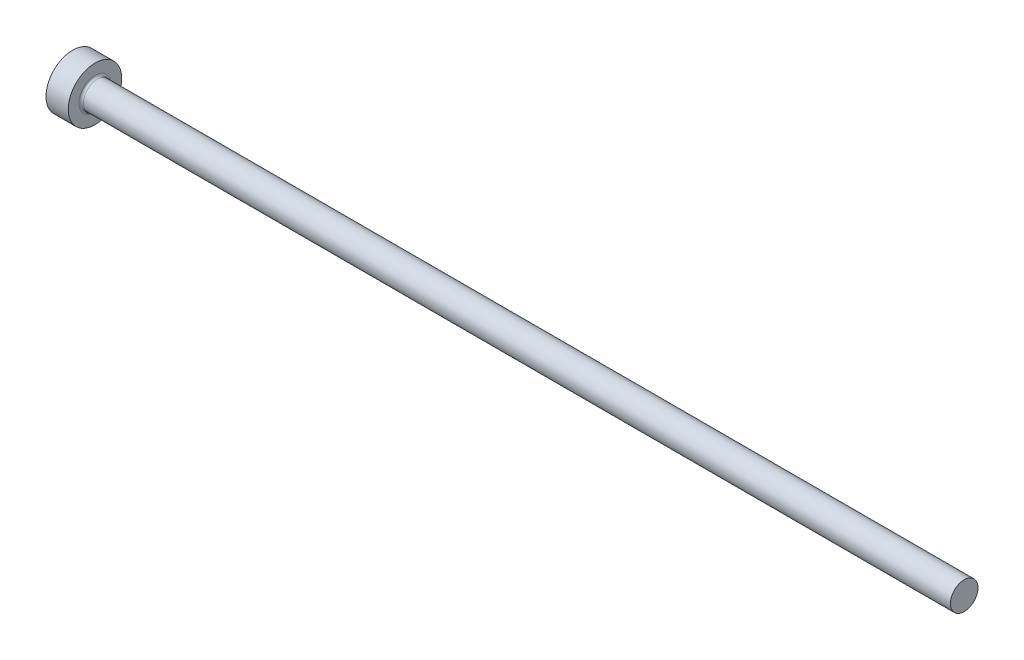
ISO-10303-21;
HEADER;
FILE_DESCRIPTION(('STEP AP214'),'2;1');
FILE_NAME('part.step','',(''),(''),'','','');
FILE_SCHEMA(('AUTOMOTIVE_DESIGN { 1 0 10303 214 1 1 1 1 }'));
ENDSEC;
DATA;
#1=APPLICATION_CONTEXT('core data for automotive mechanical design processes');
#2=APPLICATION_PROTOCOL_DEFINITION('international standard','automotive_design',2000,#1);
#3=PRODUCT_CONTEXT('',#1,'mechanical');
#4=PRODUCT('Part','Part','',(#3));
#5=PRODUCT_RELATED_PRODUCT_CATEGORY('part','',(#4));
#6=PRODUCT_DEFINITION_FORMATION('','',#4);
#7=PRODUCT_DEFINITION_CONTEXT('part definition',#1,'design');
#8=PRODUCT_DEFINITION('design','',#6,#7);
#9=PRODUCT_DEFINITION_SHAPE('','',#8);
#10=(LENGTH_UNIT() NAMED_UNIT(*) SI_UNIT(.MILLI.,.METRE.));
#11=(NAMED_UNIT(*) PLANE_ANGLE_UNIT() SI_UNIT($,.RADIAN.));
#12=(NAMED_UNIT(*) SI_UNIT($,.STERADIAN.) SOLID_ANGLE_UNIT());
#13=UNCERTAINTY_MEASURE_WITH_UNIT(LENGTH_MEASURE(1.E-05),#10,'distance_accuracy_value','');
#14=(GEOMETRIC_REPRESENTATION_CONTEXT(3) GLOBAL_UNCERTAINTY_ASSIGNED_CONTEXT((#13)) GLOBAL_UNIT_ASSIGNED_CONTEXT((#10,
#11,#12)) REPRESENTATION_CONTEXT('',''));
#15=CARTESIAN_POINT('',(0.,0.,0.));
#16=DIRECTION('',(0.,0.,1.));
#17=DIRECTION('',(1.,0.,0.));
#18=AXIS2_PLACEMENT_3D('',#15,#16,#17);
#19=CARTESIAN_POINT('',(0.,0.,0.));
#20=DIRECTION('',(-1.,0.,0.));
#21=DIRECTION('',(0.,-1.,0.));
#22=AXIS2_PLACEMENT_3D('',#19,#20,#21);
#23=PLANE('',#22);
#24=CARTESIAN_POINT('',(0.,0.,0.));
#25=DIRECTION('',(1.,0.,0.));
#26=DIRECTION('',(0.,1.,0.));
#27=AXIS2_PLACEMENT_3D('',#24,#25,#26);
#28=CIRCLE('',#27,6.);
#29=CARTESIAN_POINT('',(0.,6.,0.));
#30=VERTEX_POINT('',#29);
#31=EDGE_CURVE('E24',#30,#30,#28,.T.);
#32=ORIENTED_EDGE('',*,*,#31,.F.);
#33=EDGE_LOOP('',(#32));
#34=FACE_BOUND('',#33,.T.);
#35=ADVANCED_FACE('F13',(#34),#23,.T.);
#36=CARTESIAN_POINT('',(200.,0.,0.));
#37=DIRECTION('',(1.,0.,0.));
#38=DIRECTION('',(0.,1.,0.));
#39=AXIS2_PLACEMENT_3D('',#36,#37,#38);
#40=CYLINDRICAL_SURFACE('',#39,6.);
#41=ORIENTED_EDGE('',*,*,#31,.T.);
#42=EDGE_LOOP('',(#41));
#43=FACE_BOUND('',#42,.T.);
#44=CARTESIAN_POINT('',(5.,0.,0.));
#45=DIRECTION('',(1.,0.,0.));
#46=DIRECTION('',(0.,1.,0.));
#47=AXIS2_PLACEMENT_3D('',#44,#45,#46);
#48=CIRCLE('',#47,6.);
#49=CARTESIAN_POINT('',(5.,6.,0.));
#50=VERTEX_POINT('',#49);
#51=EDGE_CURVE('E28',#50,#50,#48,.T.);
#52=ORIENTED_EDGE('',*,*,#51,.F.);
#53=EDGE_LOOP('',(#52));
#54=FACE_BOUND('',#53,.T.);
#55=ADVANCED_FACE('F50',(#43,#54),#40,.T.);
#56=CARTESIAN_POINT('',(5.,6.,0.));
#57=DIRECTION('',(1.,0.,0.));
#58=DIRECTION('',(0.,1.,0.));
#59=AXIS2_PLACEMENT_3D('',#56,#57,#58);
#60=PLANE('',#59);
#61=CARTESIAN_POINT('',(5.,0.,0.));
#62=DIRECTION('',(1.,0.,0.));
#63=DIRECTION('',(0.,1.,0.));
#64=AXIS2_PLACEMENT_3D('',#61,#62,#63);
#65=CIRCLE('',#64,3.59999999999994);
#66=CARTESIAN_POINT('',(5.,3.59999999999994,0.));
#67=VERTEX_POINT('',#66);
#68=EDGE_CURVE('E8',#67,#67,#65,.F.);
#69=ORIENTED_EDGE('',*,*,#68,.T.);
#70=EDGE_LOOP('',(#69));
#71=FACE_BOUND('',#70,.T.);
#72=ORIENTED_EDGE('',*,*,#51,.T.);
#73=EDGE_LOOP('',(#72));
#74=FACE_BOUND('',#73,.T.);
#75=ADVANCED_FACE('F41',(#71,#74),#60,.T.);
#76=CARTESIAN_POINT('',(200.,0.,0.));
#77=DIRECTION('',(1.,0.,0.));
#78=DIRECTION('',(0.,1.,0.));
#79=AXIS2_PLACEMENT_3D('',#76,#77,#78);
#80=CYLINDRICAL_SURFACE('',#79,3.09999999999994);
#81=CARTESIAN_POINT('',(5.5,0.,0.));
#82=DIRECTION('',(1.,0.,0.));
#83=DIRECTION('',(0.,1.,0.));
#84=AXIS2_PLACEMENT_3D('',#81,#82,#83);
#85=CIRCLE('',#84,3.09999999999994);
#86=CARTESIAN_POINT('',(5.5,3.09999999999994,0.));
#87=VERTEX_POINT('',#86);
#88=EDGE_CURVE('E20',#87,#87,#85,.T.);
#89=ORIENTED_EDGE('',*,*,#88,.T.);
#90=EDGE_LOOP('',(#89));
#91=FACE_BOUND('',#90,.T.);
#92=CARTESIAN_POINT('',(200.,0.,0.));
#93=DIRECTION('',(1.,0.,0.));
#94=DIRECTION('',(0.,1.,0.));
#95=AXIS2_PLACEMENT_3D('',#92,#93,#94);
#96=CIRCLE('',#95,3.1);
#97=CARTESIAN_POINT('',(200.,3.1,0.));
#98=VERTEX_POINT('',#97);
#99=EDGE_CURVE('E33',#98,#98,#96,.T.);
#100=ORIENTED_EDGE('',*,*,#99,.F.);
#101=EDGE_LOOP('',(#100));
#102=FACE_BOUND('',#101,.T.);
#103=ADVANCED_FACE('F39',(#91,#102),#80,.T.);
#104=CARTESIAN_POINT('',(200.,3.1,0.));
#105=DIRECTION('',(1.,0.,0.));
#106=DIRECTION('',(0.,1.,0.));
#107=AXIS2_PLACEMENT_3D('',#104,#105,#106);
#108=PLANE('',#107);
#109=ORIENTED_EDGE('',*,*,#99,.T.);
#110=EDGE_LOOP('',(#109));
#111=FACE_BOUND('',#110,.T.);
#112=ADVANCED_FACE('F37',(#111),#108,.T.);
#113=CARTESIAN_POINT('',(5.5,0.,0.));
#114=DIRECTION('',(1.,0.,0.));
#115=DIRECTION('',(0.,1.,0.));
#116=AXIS2_PLACEMENT_3D('',#113,#114,#115);
#117=TOROIDAL_SURFACE('',#116,3.59999999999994,0.5);
#118=ORIENTED_EDGE('',*,*,#68,.F.);
#119=EDGE_LOOP('',(#118));
#120=FACE_BOUND('',#119,.T.);
#121=ORIENTED_EDGE('',*,*,#88,.F.);
#122=EDGE_LOOP('',(#121));
#123=FACE_BOUND('',#122,.T.);
#124=ADVANCED_FACE('F15',(#120,#123),#117,.F.);
#125=CLOSED_SHELL('',(#35,#55,#75,#103,#112,#124));
#126=MANIFOLD_SOLID_BREP('B1',#125);
#127=ADVANCED_BREP_SHAPE_REPRESENTATION('',(#18,#126),#14);
#128=SHAPE_DEFINITION_REPRESENTATION(#9,#127);
ENDSEC;
END-ISO-10303-21;
